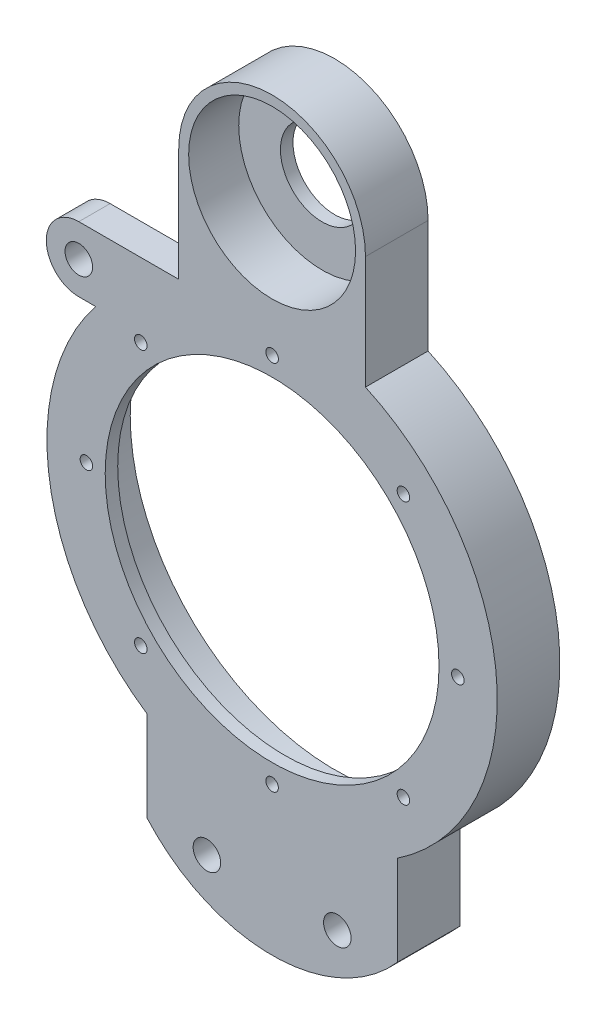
from build123d import *

# Parameters (mm, degrees)
SKETCH2_R           = 20
SKETCH2_R_2         = 3.3
SKETCH2_R_3         = 40
BOSS_EXTRUDE5_DEPTH = 15
SKETCH21_R          = 20
SKETCH21_R_2        = 10
BOSS_EXTRUDE6_DEPTH = 3
SKETCH22_R          = 49
CUT_EXTRUDE1_DEPTH  = 12
SKETCH23_R          = 1.5
CUT_EXTRUDE3_DEPTH  = 186.547128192
CUT_EXTRUDE4_START  = -15
SKETCH24_R          = 3.3
CUT_EXTRUDE4_DEPTH  = 7.5
SKETCH24_2_R        = 3.3
CUT_EXTRUDE5_DEPTH  = 186.765273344


with BuildPart() as part:
    # Sketch2 → Boss-Extrude5 (new body)
    with BuildSketch(Plane.XY):
        with BuildLine():
            Line((0, 0), (0, 21.605218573))
            ThreePointArc((0, 21.605218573), (-23.30096479, 58.09020834), (-12.289226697, 99.957033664))
            Line((-12.289226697, 99.957033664), (-16.313896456, 99.957033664))
            ThreePointArc((-16.313896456, 99.957033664), (-24.111071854, 107.754209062), (-16.313896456, 115.55138446))
            Line((-16.313896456, 115.55138446), (7.630079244, 115.55138446))
            Line((7.630079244, 115.55138446), (7.630079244, 142.651168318))
            ThreePointArc((7.630079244, 142.651168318), (30.005594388, 165.026683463), (52.381109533, 142.651168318))
            Line((52.381109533, 142.651168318), (52.381109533, 115.55138446))
            ThreePointArc((52.381109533, 115.55138446), (83.786777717, 70.819145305), (60.011188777, 21.605218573))
            Line((60.011188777, 21.605218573), (60.011188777, 0))
            ThreePointArc((60.011188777, 0), (30.005594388, -13.548831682), (0, 0))
        make_face()
        with Locations((30.005594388, 142.651168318)):
            Circle(SKETCH2_R, mode=Mode.SUBTRACT)
        with Locations((14.380594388, -0.536865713)):
            Circle(SKETCH2_R_2, mode=Mode.SUBTRACT)
        with Locations(Location((45.630594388, -0.536865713, 0), (0, 0, 180))):
            Circle(SKETCH2_R_2, mode=Mode.SUBTRACT)
        with Locations((30.005594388, 66.451168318)):
            Circle(SKETCH2_R_3, mode=Mode.SUBTRACT)
    extrude(amount=BOSS_EXTRUDE5_DEPTH)

    # Sketch21 → Boss-Extrude6 (add)
    with BuildSketch(Plane(origin=(0, 0, 0), x_dir=(-1, 0, 0), z_dir=(0, 0, -1))):
        with Locations((-30.005594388, 142.651168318)):
            Circle(SKETCH21_R)
        with Locations((-30.005594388, 142.651168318)):
            Circle(SKETCH21_R_2, mode=Mode.SUBTRACT)
    extrude(amount=-BOSS_EXTRUDE6_DEPTH)

    # Sketch22 → Cut-Extrude1 (cut)
    with BuildSketch(Plane(origin=(0, 0, 0), x_dir=(-1, 0, 0), z_dir=(0, 0, -1))):
        with Locations((-30.005594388, 66.451168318)):
            Circle(SKETCH22_R)
    extrude(amount=-CUT_EXTRUDE1_DEPTH, mode=Mode.SUBTRACT)

    # Sketch23 → Cut-Extrude3 (cut, through all)
    with BuildSketch(Plane(origin=(0, 0, 12), x_dir=(-1, 0, 0), z_dir=(0, 0, -1))):
        with Locations((-30.005594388, 110.951168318)):
            Circle(SKETCH23_R)
        with Locations((1.460657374, 97.917420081)):
            Circle(SKETCH23_R)
        with Locations((14.494405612, 66.451168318)):
            Circle(SKETCH23_R)
        with Locations((1.460657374, 34.984916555)):
            Circle(SKETCH23_R)
        with Locations((-30.005594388, 21.951168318)):
            Circle(SKETCH23_R)
        with Locations((-61.471846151, 34.984916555)):
            Circle(SKETCH23_R)
        with Locations((-74.505594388, 66.451168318)):
            Circle(SKETCH23_R)
        with Locations((-61.471846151, 97.917420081)):
            Circle(SKETCH23_R)
    extrude(amount=-CUT_EXTRUDE3_DEPTH, mode=Mode.SUBTRACT)

    # Sketch24 → Cut-Extrude4 (cut)
    with BuildSketch(Plane.XY.offset(15).offset(CUT_EXTRUDE4_START)):
        with BuildLine():
            Line((7.630079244, 115.55138446), (-16.313896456, 115.55138446))
            ThreePointArc((-16.313896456, 115.55138446), (-24.111071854, 107.754209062), (-16.313896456, 99.957033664))
            Line((-16.313896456, 99.957033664), (-12.289226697, 99.957033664))
            ThreePointArc((-12.289226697, 99.957033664), (-3.256381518, 108.93805879), (7.630079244, 115.55138446))
        make_face()
        with Locations(Location((-16.313896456, 107.754209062, 0), (0, 0, 180))):
            Circle(SKETCH24_R, mode=Mode.SUBTRACT)
    extrude(amount=CUT_EXTRUDE4_DEPTH, mode=Mode.SUBTRACT)

    # Sketch24_2 → Cut-Extrude5 (cut, through all)
    with BuildSketch(Plane.XY.offset(15)):
        with Locations((-16.313896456, 107.754209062)):
            Circle(SKETCH24_2_R)
    extrude(amount=-CUT_EXTRUDE5_DEPTH, mode=Mode.SUBTRACT)


solid = part.part
